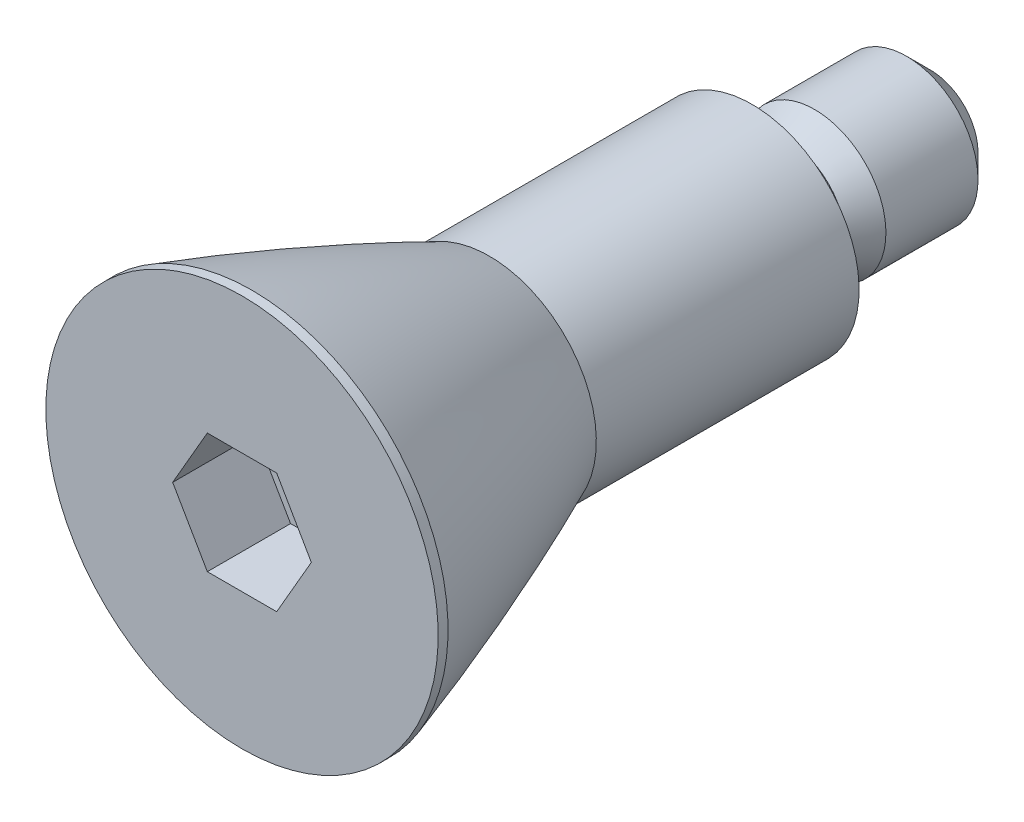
ISO-10303-21;
HEADER;
FILE_DESCRIPTION(('STEP AP214'),'2;1');
FILE_NAME('part.step','',(''),(''),'','','');
FILE_SCHEMA(('AUTOMOTIVE_DESIGN { 1 0 10303 214 1 1 1 1 }'));
ENDSEC;
DATA;
#1=APPLICATION_CONTEXT('core data for automotive mechanical design processes');
#2=APPLICATION_PROTOCOL_DEFINITION('international standard','automotive_design',2000,#1);
#3=PRODUCT_CONTEXT('',#1,'mechanical');
#4=PRODUCT('Part','Part','',(#3));
#5=PRODUCT_RELATED_PRODUCT_CATEGORY('part','',(#4));
#6=PRODUCT_DEFINITION_FORMATION('','',#4);
#7=PRODUCT_DEFINITION_CONTEXT('part definition',#1,'design');
#8=PRODUCT_DEFINITION('design','',#6,#7);
#9=PRODUCT_DEFINITION_SHAPE('','',#8);
#10=(LENGTH_UNIT() NAMED_UNIT(*) SI_UNIT(.MILLI.,.METRE.));
#11=(NAMED_UNIT(*) PLANE_ANGLE_UNIT() SI_UNIT($,.RADIAN.));
#12=(NAMED_UNIT(*) SI_UNIT($,.STERADIAN.) SOLID_ANGLE_UNIT());
#13=UNCERTAINTY_MEASURE_WITH_UNIT(LENGTH_MEASURE(1.E-05),#10,'distance_accuracy_value','');
#14=(GEOMETRIC_REPRESENTATION_CONTEXT(3) GLOBAL_UNCERTAINTY_ASSIGNED_CONTEXT((#13)) GLOBAL_UNIT_ASSIGNED_CONTEXT((#10,
#11,#12)) REPRESENTATION_CONTEXT('',''));
#15=CARTESIAN_POINT('',(0.,0.,0.));
#16=DIRECTION('',(0.,0.,1.));
#17=DIRECTION('',(1.,0.,0.));
#18=AXIS2_PLACEMENT_3D('',#15,#16,#17);
#19=CARTESIAN_POINT('',(5.85,0.,0.));
#20=DIRECTION('',(0.,0.,1.));
#21=DIRECTION('',(0.,-1.,0.));
#22=AXIS2_PLACEMENT_3D('',#19,#20,#21);
#23=PLANE('',#22);
#24=CARTESIAN_POINT('',(0.,0.,0.));
#25=DIRECTION('',(0.,0.,1.));
#26=DIRECTION('',(0.,-1.,0.));
#27=AXIS2_PLACEMENT_3D('',#24,#25,#26);
#28=CIRCLE('',#27,4.85);
#29=CARTESIAN_POINT('',(0.,-4.85,0.));
#30=VERTEX_POINT('',#29);
#31=EDGE_CURVE('E9',#30,#30,#28,.F.);
#32=ORIENTED_EDGE('',*,*,#31,.F.);
#33=EDGE_LOOP('',(#32));
#34=FACE_BOUND('',#33,.T.);
#35=CARTESIAN_POINT('',(0.,0.,0.));
#36=DIRECTION('',(0.,0.,1.));
#37=DIRECTION('',(0.,-1.,0.));
#38=AXIS2_PLACEMENT_3D('',#35,#36,#37);
#39=CIRCLE('',#38,9.);
#40=CARTESIAN_POINT('',(0.,-9.,0.));
#41=VERTEX_POINT('',#40);
#42=EDGE_CURVE('E145',#41,#41,#39,.T.);
#43=ORIENTED_EDGE('',*,*,#42,.F.);
#44=EDGE_LOOP('',(#43));
#45=FACE_BOUND('',#44,.T.);
#46=ADVANCED_FACE('F15',(#34,#45),#23,.F.);
#47=CARTESIAN_POINT('',(0.,-1.40593215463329E-13,40.2674973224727));
#48=DIRECTION('',(0.,0.,1.));
#49=DIRECTION('',(0.,-1.,0.));
#50=AXIS2_PLACEMENT_3D('',#47,#48,#49);
#51=CYLINDRICAL_SURFACE('',#50,9.);
#52=ORIENTED_EDGE('',*,*,#42,.T.);
#53=EDGE_LOOP('',(#52));
#54=FACE_BOUND('',#53,.T.);
#55=CARTESIAN_POINT('',(0.,0.,22.1009345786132));
#56=DIRECTION('',(0.,0.,1.));
#57=DIRECTION('',(0.,-1.,0.));
#58=AXIS2_PLACEMENT_3D('',#55,#56,#57);
#59=CIRCLE('',#58,9.);
#60=CARTESIAN_POINT('',(0.,-9.00000000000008,22.1009345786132));
#61=VERTEX_POINT('',#60);
#62=EDGE_CURVE('E113',#61,#61,#59,.T.);
#63=ORIENTED_EDGE('',*,*,#62,.F.);
#64=EDGE_LOOP('',(#63));
#65=FACE_BOUND('',#64,.T.);
#66=ADVANCED_FACE('F189',(#54,#65),#51,.T.);
#67=CARTESIAN_POINT('',(0.,0.,-15.));
#68=DIRECTION('',(0.,0.,1.));
#69=DIRECTION('',(0.,-1.,0.));
#70=AXIS2_PLACEMENT_3D('',#67,#68,#69);
#71=PLANE('',#70);
#72=CARTESIAN_POINT('',(0.,0.,-15.));
#73=DIRECTION('',(0.,0.,1.));
#74=DIRECTION('',(0.,-1.,0.));
#75=AXIS2_PLACEMENT_3D('',#72,#73,#74);
#76=CIRCLE('',#75,4.);
#77=CARTESIAN_POINT('',(0.,-3.99999999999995,-15.));
#78=VERTEX_POINT('',#77);
#79=EDGE_CURVE('E161',#78,#78,#76,.F.);
#80=ORIENTED_EDGE('',*,*,#79,.T.);
#81=EDGE_LOOP('',(#80));
#82=FACE_BOUND('',#81,.T.);
#83=ADVANCED_FACE('F195',(#82),#71,.F.);
#84=CARTESIAN_POINT('',(0.,-1.40593215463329E-13,40.2674973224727));
#85=DIRECTION('',(0.,0.,1.));
#86=DIRECTION('',(0.,-1.,0.));
#87=AXIS2_PLACEMENT_3D('',#84,#85,#86);
#88=CYLINDRICAL_SURFACE('',#87,6.);
#89=CARTESIAN_POINT('',(0.,0.,-13.));
#90=DIRECTION('',(0.,0.,1.));
#91=DIRECTION('',(0.,-1.,0.));
#92=AXIS2_PLACEMENT_3D('',#89,#90,#91);
#93=CIRCLE('',#92,6.);
#94=CARTESIAN_POINT('',(0.,-5.99999999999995,-13.));
#95=VERTEX_POINT('',#94);
#96=EDGE_CURVE('E157',#95,#95,#93,.T.);
#97=ORIENTED_EDGE('',*,*,#96,.T.);
#98=EDGE_LOOP('',(#97));
#99=FACE_BOUND('',#98,.T.);
#100=CARTESIAN_POINT('',(0.,0.,-5.25700208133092));
#101=DIRECTION('',(0.,0.,1.));
#102=DIRECTION('',(0.,-1.,0.));
#103=AXIS2_PLACEMENT_3D('',#100,#101,#102);
#104=CIRCLE('',#103,6.);
#105=CARTESIAN_POINT('',(0.,-5.99999999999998,-5.25700208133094));
#106=VERTEX_POINT('',#105);
#107=EDGE_CURVE('E153',#106,#106,#104,.T.);
#108=ORIENTED_EDGE('',*,*,#107,.F.);
#109=EDGE_LOOP('',(#108));
#110=FACE_BOUND('',#109,.T.);
#111=ADVANCED_FACE('F204',(#99,#110),#88,.T.);
#112=CARTESIAN_POINT('',(0.,0.,-5.25700208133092));
#113=DIRECTION('',(0.,0.,-1.));
#114=DIRECTION('',(0.,1.,0.));
#115=AXIS2_PLACEMENT_3D('',#112,#113,#114);
#116=CONICAL_SURFACE('',#115,6.,0.47123889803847);
#117=CARTESIAN_POINT('',(0.,0.,-3.));
#118=DIRECTION('',(0.,0.,1.));
#119=DIRECTION('',(0.,-1.,0.));
#120=AXIS2_PLACEMENT_3D('',#117,#118,#119);
#121=CIRCLE('',#120,4.85);
#122=CARTESIAN_POINT('',(0.,-4.84999999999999,-3.00000000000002));
#123=VERTEX_POINT('',#122);
#124=EDGE_CURVE('E149',#123,#123,#121,.T.);
#125=ORIENTED_EDGE('',*,*,#124,.F.);
#126=EDGE_LOOP('',(#125));
#127=FACE_BOUND('',#126,.T.);
#128=ORIENTED_EDGE('',*,*,#107,.T.);
#129=EDGE_LOOP('',(#128));
#130=FACE_BOUND('',#129,.T.);
#131=ADVANCED_FACE('F201',(#127,#130),#116,.T.);
#132=CARTESIAN_POINT('',(0.,-1.40593215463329E-13,40.2674973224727));
#133=DIRECTION('',(0.,0.,1.));
#134=DIRECTION('',(0.,-1.,0.));
#135=AXIS2_PLACEMENT_3D('',#132,#133,#134);
#136=CYLINDRICAL_SURFACE('',#135,4.85);
#137=ORIENTED_EDGE('',*,*,#124,.T.);
#138=EDGE_LOOP('',(#137));
#139=FACE_BOUND('',#138,.T.);
#140=ORIENTED_EDGE('',*,*,#31,.T.);
#141=EDGE_LOOP('',(#140));
#142=FACE_BOUND('',#141,.T.);
#143=ADVANCED_FACE('F17',(#139,#142),#136,.T.);
#144=CARTESIAN_POINT('',(0.,0.,-13.));
#145=DIRECTION('',(0.,0.,1.));
#146=DIRECTION('',(0.,-1.,0.));
#147=AXIS2_PLACEMENT_3D('',#144,#145,#146);
#148=CONICAL_SURFACE('',#147,6.,0.785398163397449);
#149=ORIENTED_EDGE('',*,*,#79,.F.);
#150=EDGE_LOOP('',(#149));
#151=FACE_BOUND('',#150,.T.);
#152=ORIENTED_EDGE('',*,*,#96,.F.);
#153=EDGE_LOOP('',(#152));
#154=FACE_BOUND('',#153,.T.);
#155=ADVANCED_FACE('F211',(#151,#154),#148,.T.);
#156=CARTESIAN_POINT('',(0.,-3.57192606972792E-13,102.304028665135));
#157=DIRECTION('',(0.,0.,1.));
#158=DIRECTION('',(0.,-1.,0.));
#159=AXIS2_PLACEMENT_3D('',#156,#157,#158);
#160=DEGENERATE_TOROIDAL_SURFACE('',#159,174.214256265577,200.,.F.);
#161=CARTESIAN_POINT('',(0.,-1.46888525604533E-13,42.0705458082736));
#162=DIRECTION('',(0.,0.,1.));
#163=DIRECTION('',(0.,-1.,0.));
#164=AXIS2_PLACEMENT_3D('',#161,#162,#163);
#165=CIRCLE('',#164,16.5);
#166=CARTESIAN_POINT('',(0.,-16.5000000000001,42.0705458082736));
#167=VERTEX_POINT('',#166);
#168=EDGE_CURVE('E24',#167,#167,#165,.F.);
#169=ORIENTED_EDGE('',*,*,#168,.T.);
#170=EDGE_LOOP('',(#169));
#171=FACE_BOUND('',#170,.T.);
#172=ORIENTED_EDGE('',*,*,#62,.T.);
#173=EDGE_LOOP('',(#172));
#174=FACE_BOUND('',#173,.T.);
#175=ADVANCED_FACE('F171',(#171,#174),#160,.F.);
#176=CARTESIAN_POINT('',(2.91561885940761,5.04999999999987,35.9));
#177=DIRECTION('',(0.,0.,1.));
#178=DIRECTION('',(0.,-1.,0.));
#179=AXIS2_PLACEMENT_3D('',#176,#177,#178);
#180=PLANE('',#179);
#181=DIRECTION('',(-0.5,0.866025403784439,0.));
#182=VECTOR('',#181,1.);
#183=CARTESIAN_POINT('',(5.83123771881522,-1.25344180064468E-13,35.9));
#184=LINE('',#183,#182);
#185=CARTESIAN_POINT('',(5.83123771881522,-1.25344180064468E-13,35.9));
#186=VERTEX_POINT('',#185);
#187=CARTESIAN_POINT('',(2.91561885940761,5.04999999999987,35.9));
#188=VERTEX_POINT('',#187);
#189=EDGE_CURVE('E129',#186,#188,#184,.T.);
#190=ORIENTED_EDGE('',*,*,#189,.T.);
#191=DIRECTION('',(-1.,0.,0.));
#192=VECTOR('',#191,1.);
#193=CARTESIAN_POINT('',(2.91561885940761,5.04999999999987,35.9));
#194=LINE('',#193,#192);
#195=CARTESIAN_POINT('',(-2.91561885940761,5.04999999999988,35.9));
#196=VERTEX_POINT('',#195);
#197=EDGE_CURVE('E104',#188,#196,#194,.T.);
#198=ORIENTED_EDGE('',*,*,#197,.T.);
#199=DIRECTION('',(-0.5,-0.866025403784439,0.));
#200=VECTOR('',#199,1.);
#201=CARTESIAN_POINT('',(-2.91561885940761,5.04999999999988,35.9));
#202=LINE('',#201,#200);
#203=CARTESIAN_POINT('',(-5.83123771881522,-1.27453218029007E-13,35.9));
#204=VERTEX_POINT('',#203);
#205=EDGE_CURVE('E99',#196,#204,#202,.T.);
#206=ORIENTED_EDGE('',*,*,#205,.T.);
#207=DIRECTION('',(0.5,-0.866025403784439,0.));
#208=VECTOR('',#207,1.);
#209=CARTESIAN_POINT('',(-5.83123771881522,-1.27453218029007E-13,35.9));
#210=LINE('',#209,#208);
#211=CARTESIAN_POINT('',(-2.91561885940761,-5.05000000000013,35.9));
#212=VERTEX_POINT('',#211);
#213=EDGE_CURVE('E76',#204,#212,#210,.T.);
#214=ORIENTED_EDGE('',*,*,#213,.T.);
#215=DIRECTION('',(1.,0.,0.));
#216=VECTOR('',#215,1.);
#217=CARTESIAN_POINT('',(-2.91561885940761,-5.05000000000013,35.9));
#218=LINE('',#217,#216);
#219=CARTESIAN_POINT('',(2.91561885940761,-5.05000000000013,35.9));
#220=VERTEX_POINT('',#219);
#221=EDGE_CURVE('E88',#212,#220,#218,.T.);
#222=ORIENTED_EDGE('',*,*,#221,.T.);
#223=DIRECTION('',(0.5,0.866025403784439,0.));
#224=VECTOR('',#223,1.);
#225=CARTESIAN_POINT('',(2.91561885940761,-5.05000000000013,35.9));
#226=LINE('',#225,#224);
#227=EDGE_CURVE('E93',#220,#186,#226,.T.);
#228=ORIENTED_EDGE('',*,*,#227,.T.);
#229=EDGE_LOOP('',(#190,#198,#206,#214,#222,#228));
#230=FACE_BOUND('',#229,.T.);
#231=ADVANCED_FACE('F96',(#230),#180,.T.);
#232=CARTESIAN_POINT('',(-2.91561885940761,5.04999999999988,35.9));
#233=DIRECTION('',(-0.866025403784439,0.5,0.));
#234=DIRECTION('',(-0.5,-0.866025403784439,0.));
#235=AXIS2_PLACEMENT_3D('',#232,#233,#234);
#236=PLANE('',#235);
#237=DIRECTION('',(-0.5,-0.866025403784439,0.));
#238=VECTOR('',#237,1.);
#239=CARTESIAN_POINT('',(-2.91561885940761,5.04999999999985,42.9));
#240=LINE('',#239,#238);
#241=CARTESIAN_POINT('',(-2.91561885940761,5.04999999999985,42.9));
#242=VERTEX_POINT('',#241);
#243=CARTESIAN_POINT('',(-5.83123771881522,-1.51893587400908E-13,42.9));
#244=VERTEX_POINT('',#243);
#245=EDGE_CURVE('E117',#242,#244,#240,.T.);
#246=ORIENTED_EDGE('',*,*,#245,.T.);
#247=DIRECTION('',(0.,0.,1.));
#248=VECTOR('',#247,1.);
#249=CARTESIAN_POINT('',(-5.83123771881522,-1.27453218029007E-13,35.9));
#250=LINE('',#249,#248);
#251=EDGE_CURVE('E85',#204,#244,#250,.T.);
#252=ORIENTED_EDGE('',*,*,#251,.F.);
#253=ORIENTED_EDGE('',*,*,#205,.F.);
#254=DIRECTION('',(0.,0.,1.));
#255=VECTOR('',#254,1.);
#256=CARTESIAN_POINT('',(-2.91561885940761,5.04999999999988,35.9));
#257=LINE('',#256,#255);
#258=EDGE_CURVE('E137',#196,#242,#257,.T.);
#259=ORIENTED_EDGE('',*,*,#258,.T.);
#260=EDGE_LOOP('',(#246,#252,#253,#259));
#261=FACE_BOUND('',#260,.T.);
#262=ADVANCED_FACE('F316',(#261),#236,.F.);
#263=CARTESIAN_POINT('',(-5.83123771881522,-1.27453218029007E-13,35.9));
#264=DIRECTION('',(-0.866025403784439,-0.5,0.));
#265=DIRECTION('',(0.5,-0.866025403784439,0.));
#266=AXIS2_PLACEMENT_3D('',#263,#264,#265);
#267=PLANE('',#266);
#268=DIRECTION('',(0.5,-0.866025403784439,0.));
#269=VECTOR('',#268,1.);
#270=CARTESIAN_POINT('',(-5.83123771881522,-1.51893587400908E-13,42.9));
#271=LINE('',#270,#269);
#272=CARTESIAN_POINT('',(-2.91561885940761,-5.05000000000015,42.9));
#273=VERTEX_POINT('',#272);
#274=EDGE_CURVE('E79',#244,#273,#271,.T.);
#275=ORIENTED_EDGE('',*,*,#274,.T.);
#276=DIRECTION('',(0.,0.,1.));
#277=VECTOR('',#276,1.);
#278=CARTESIAN_POINT('',(-2.91561885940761,-5.05000000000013,35.9));
#279=LINE('',#278,#277);
#280=EDGE_CURVE('E72',#212,#273,#279,.T.);
#281=ORIENTED_EDGE('',*,*,#280,.F.);
#282=ORIENTED_EDGE('',*,*,#213,.F.);
#283=ORIENTED_EDGE('',*,*,#251,.T.);
#284=EDGE_LOOP('',(#275,#281,#282,#283));
#285=FACE_BOUND('',#284,.T.);
#286=ADVANCED_FACE('F74',(#285),#267,.F.);
#287=CARTESIAN_POINT('',(-2.91561885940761,-5.05000000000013,35.9));
#288=DIRECTION('',(0.,-1.,0.));
#289=DIRECTION('',(1.,0.,0.));
#290=AXIS2_PLACEMENT_3D('',#287,#288,#289);
#291=PLANE('',#290);
#292=DIRECTION('',(1.,0.,0.));
#293=VECTOR('',#292,1.);
#294=CARTESIAN_POINT('',(-2.91561885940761,-5.05000000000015,42.9));
#295=LINE('',#294,#293);
#296=CARTESIAN_POINT('',(2.91561885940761,-5.05000000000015,42.9));
#297=VERTEX_POINT('',#296);
#298=EDGE_CURVE('E123',#273,#297,#295,.T.);
#299=ORIENTED_EDGE('',*,*,#298,.T.);
#300=DIRECTION('',(0.,0.,1.));
#301=VECTOR('',#300,1.);
#302=CARTESIAN_POINT('',(2.91561885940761,-5.05000000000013,35.9));
#303=LINE('',#302,#301);
#304=EDGE_CURVE('E84',#220,#297,#303,.T.);
#305=ORIENTED_EDGE('',*,*,#304,.F.);
#306=ORIENTED_EDGE('',*,*,#221,.F.);
#307=ORIENTED_EDGE('',*,*,#280,.T.);
#308=EDGE_LOOP('',(#299,#305,#306,#307));
#309=FACE_BOUND('',#308,.T.);
#310=ADVANCED_FACE('F89',(#309),#291,.F.);
#311=CARTESIAN_POINT('',(2.91561885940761,-5.05000000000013,35.9));
#312=DIRECTION('',(0.866025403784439,-0.5,0.));
#313=DIRECTION('',(0.5,0.866025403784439,0.));
#314=AXIS2_PLACEMENT_3D('',#311,#312,#313);
#315=PLANE('',#314);
#316=DIRECTION('',(0.5,0.866025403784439,0.));
#317=VECTOR('',#316,1.);
#318=CARTESIAN_POINT('',(2.91561885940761,-5.05000000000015,42.9));
#319=LINE('',#318,#317);
#320=CARTESIAN_POINT('',(5.83123771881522,-1.4978454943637E-13,42.9));
#321=VERTEX_POINT('',#320);
#322=EDGE_CURVE('E126',#297,#321,#319,.T.);
#323=ORIENTED_EDGE('',*,*,#322,.T.);
#324=DIRECTION('',(0.,0.,1.));
#325=VECTOR('',#324,1.);
#326=CARTESIAN_POINT('',(5.83123771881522,-1.25344180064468E-13,35.9));
#327=LINE('',#326,#325);
#328=EDGE_CURVE('E39',#186,#321,#327,.T.);
#329=ORIENTED_EDGE('',*,*,#328,.F.);
#330=ORIENTED_EDGE('',*,*,#227,.F.);
#331=ORIENTED_EDGE('',*,*,#304,.T.);
#332=EDGE_LOOP('',(#323,#329,#330,#331));
#333=FACE_BOUND('',#332,.T.);
#334=ADVANCED_FACE('F291',(#333),#315,.F.);
#335=CARTESIAN_POINT('',(5.83123771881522,-1.25344180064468E-13,35.9));
#336=DIRECTION('',(0.866025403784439,0.5,0.));
#337=DIRECTION('',(-0.5,0.866025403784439,0.));
#338=AXIS2_PLACEMENT_3D('',#335,#336,#337);
#339=PLANE('',#338);
#340=DIRECTION('',(-0.5,0.866025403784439,0.));
#341=VECTOR('',#340,1.);
#342=CARTESIAN_POINT('',(5.83123771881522,-1.4978454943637E-13,42.9));
#343=LINE('',#342,#341);
#344=CARTESIAN_POINT('',(2.91561885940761,5.04999999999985,42.9));
#345=VERTEX_POINT('',#344);
#346=EDGE_CURVE('E31',#321,#345,#343,.T.);
#347=ORIENTED_EDGE('',*,*,#346,.T.);
#348=DIRECTION('',(0.,0.,1.));
#349=VECTOR('',#348,1.);
#350=CARTESIAN_POINT('',(2.91561885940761,5.04999999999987,35.9));
#351=LINE('',#350,#349);
#352=EDGE_CURVE('E61',#188,#345,#351,.T.);
#353=ORIENTED_EDGE('',*,*,#352,.F.);
#354=ORIENTED_EDGE('',*,*,#189,.F.);
#355=ORIENTED_EDGE('',*,*,#328,.T.);
#356=EDGE_LOOP('',(#347,#353,#354,#355));
#357=FACE_BOUND('',#356,.T.);
#358=ADVANCED_FACE('F281',(#357),#339,.F.);
#359=CARTESIAN_POINT('',(2.91561885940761,5.04999999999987,35.9));
#360=DIRECTION('',(0.,1.,0.));
#361=DIRECTION('',(-1.,0.,0.));
#362=AXIS2_PLACEMENT_3D('',#359,#360,#361);
#363=PLANE('',#362);
#364=DIRECTION('',(-1.,0.,0.));
#365=VECTOR('',#364,1.);
#366=CARTESIAN_POINT('',(2.91561885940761,5.04999999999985,42.9));
#367=LINE('',#366,#365);
#368=EDGE_CURVE('E112',#345,#242,#367,.T.);
#369=ORIENTED_EDGE('',*,*,#368,.T.);
#370=ORIENTED_EDGE('',*,*,#258,.F.);
#371=ORIENTED_EDGE('',*,*,#197,.F.);
#372=ORIENTED_EDGE('',*,*,#352,.T.);
#373=EDGE_LOOP('',(#369,#370,#371,#372));
#374=FACE_BOUND('',#373,.T.);
#375=ADVANCED_FACE('F183',(#374),#363,.F.);
#376=CARTESIAN_POINT('',(0.,-1.4978454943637E-13,42.9));
#377=DIRECTION('',(0.,0.,-1.));
#378=DIRECTION('',(0.,1.,0.));
#379=AXIS2_PLACEMENT_3D('',#376,#377,#378);
#380=PLANE('',#379);
#381=ORIENTED_EDGE('',*,*,#368,.F.);
#382=ORIENTED_EDGE('',*,*,#346,.F.);
#383=ORIENTED_EDGE('',*,*,#322,.F.);
#384=ORIENTED_EDGE('',*,*,#298,.F.);
#385=ORIENTED_EDGE('',*,*,#274,.F.);
#386=ORIENTED_EDGE('',*,*,#245,.F.);
#387=EDGE_LOOP('',(#381,#382,#383,#384,#385,#386));
#388=FACE_BOUND('',#387,.T.);
#389=CARTESIAN_POINT('',(0.,-1.4978454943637E-13,42.9));
#390=DIRECTION('',(0.,0.,1.));
#391=DIRECTION('',(0.,-1.,0.));
#392=AXIS2_PLACEMENT_3D('',#389,#390,#391);
#393=CIRCLE('',#392,16.5);
#394=CARTESIAN_POINT('',(0.,-16.5000000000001,42.8999999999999));
#395=VERTEX_POINT('',#394);
#396=EDGE_CURVE('E132',#395,#395,#393,.T.);
#397=ORIENTED_EDGE('',*,*,#396,.T.);
#398=EDGE_LOOP('',(#397));
#399=FACE_BOUND('',#398,.T.);
#400=ADVANCED_FACE('F176',(#388,#399),#380,.F.);
#401=CARTESIAN_POINT('',(0.,-1.40593215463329E-13,40.2674973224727));
#402=DIRECTION('',(0.,0.,1.));
#403=DIRECTION('',(0.,-1.,0.));
#404=AXIS2_PLACEMENT_3D('',#401,#402,#403);
#405=CYLINDRICAL_SURFACE('',#404,16.5);
#406=ORIENTED_EDGE('',*,*,#396,.F.);
#407=EDGE_LOOP('',(#406));
#408=FACE_BOUND('',#407,.T.);
#409=ORIENTED_EDGE('',*,*,#168,.F.);
#410=EDGE_LOOP('',(#409));
#411=FACE_BOUND('',#410,.T.);
#412=ADVANCED_FACE('F174',(#408,#411),#405,.T.);
#413=CLOSED_SHELL('',(#46,#66,#83,#111,#131,#143,#155,#175,#231,#262,#286,#310,#334,#358,#375,
#400,#412));
#414=MANIFOLD_SOLID_BREP('B1',#413);
#415=ADVANCED_BREP_SHAPE_REPRESENTATION('',(#18,#414),#14);
#416=SHAPE_DEFINITION_REPRESENTATION(#9,#415);
ENDSEC;
END-ISO-10303-21;
